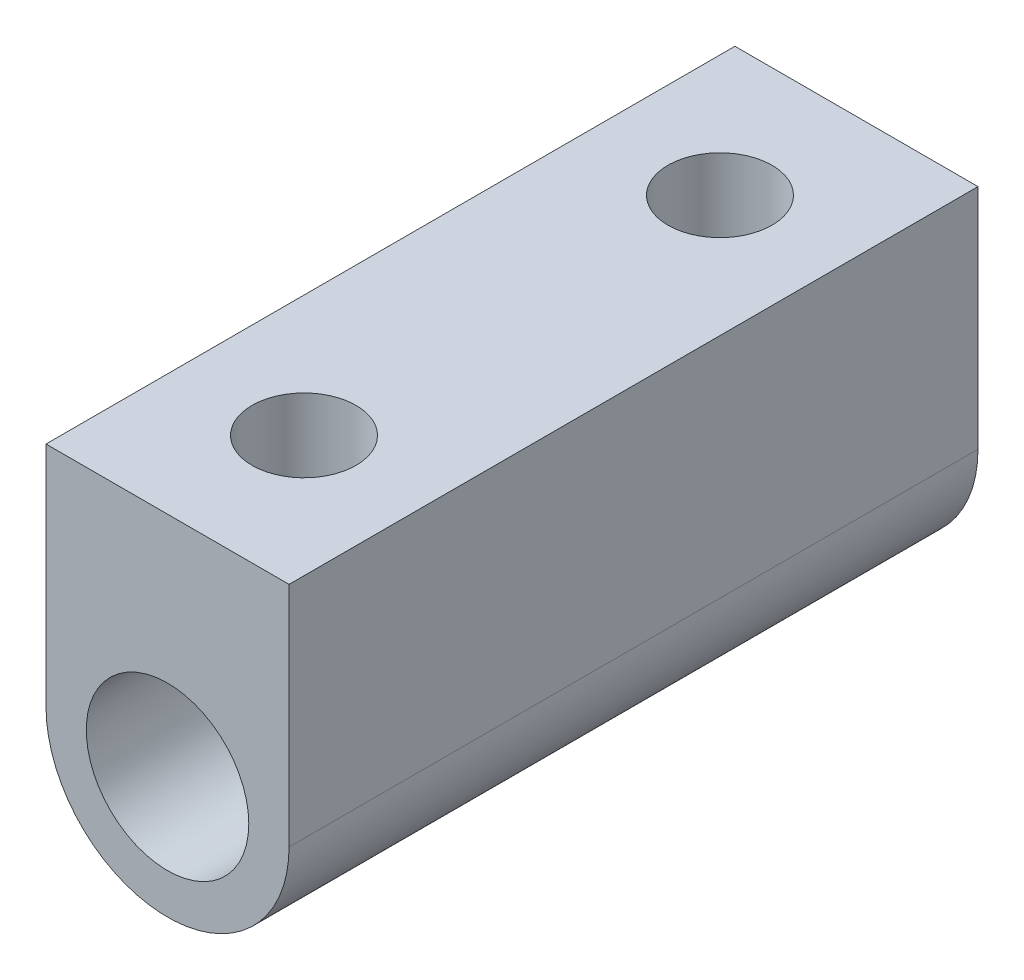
ISO-10303-21;
HEADER;
FILE_DESCRIPTION(('STEP AP214'),'2;1');
FILE_NAME('part.step','',(''),(''),'','','');
FILE_SCHEMA(('AUTOMOTIVE_DESIGN { 1 0 10303 214 1 1 1 1 }'));
ENDSEC;
DATA;
#1=APPLICATION_CONTEXT('core data for automotive mechanical design processes');
#2=APPLICATION_PROTOCOL_DEFINITION('international standard','automotive_design',2000,#1);
#3=PRODUCT_CONTEXT('',#1,'mechanical');
#4=PRODUCT('Part','Part','',(#3));
#5=PRODUCT_RELATED_PRODUCT_CATEGORY('part','',(#4));
#6=PRODUCT_DEFINITION_FORMATION('','',#4);
#7=PRODUCT_DEFINITION_CONTEXT('part definition',#1,'design');
#8=PRODUCT_DEFINITION('design','',#6,#7);
#9=PRODUCT_DEFINITION_SHAPE('','',#8);
#10=(LENGTH_UNIT() NAMED_UNIT(*) SI_UNIT(.MILLI.,.METRE.));
#11=(NAMED_UNIT(*) PLANE_ANGLE_UNIT() SI_UNIT($,.RADIAN.));
#12=(NAMED_UNIT(*) SI_UNIT($,.STERADIAN.) SOLID_ANGLE_UNIT());
#13=UNCERTAINTY_MEASURE_WITH_UNIT(LENGTH_MEASURE(1.E-05),#10,'distance_accuracy_value','');
#14=(GEOMETRIC_REPRESENTATION_CONTEXT(3) GLOBAL_UNCERTAINTY_ASSIGNED_CONTEXT((#13)) GLOBAL_UNIT_ASSIGNED_CONTEXT((#10,
#11,#12)) REPRESENTATION_CONTEXT('',''));
#15=CARTESIAN_POINT('',(0.,0.,0.));
#16=DIRECTION('',(0.,0.,1.));
#17=DIRECTION('',(1.,0.,0.));
#18=AXIS2_PLACEMENT_3D('',#15,#16,#17);
#19=CARTESIAN_POINT('',(1.87,0.,14.3440430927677));
#20=DIRECTION('',(-1.,0.,0.));
#21=DIRECTION('',(0.,0.,1.));
#22=AXIS2_PLACEMENT_3D('',#19,#20,#21);
#23=PLANE('',#22);
#24=DIRECTION('',(0.,0.,-1.));
#25=VECTOR('',#24,1.);
#26=CARTESIAN_POINT('',(1.87,3.5,14.3440430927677));
#27=LINE('',#26,#25);
#28=CARTESIAN_POINT('',(1.87,3.5,5.3));
#29=VERTEX_POINT('',#28);
#30=CARTESIAN_POINT('',(1.87,3.5,-5.3));
#31=VERTEX_POINT('',#30);
#32=EDGE_CURVE('E110',#29,#31,#27,.T.);
#33=ORIENTED_EDGE('',*,*,#32,.F.);
#34=DIRECTION('',(0.,-1.,0.));
#35=VECTOR('',#34,1.);
#36=CARTESIAN_POINT('',(1.87,0.,5.3));
#37=LINE('',#36,#35);
#38=CARTESIAN_POINT('',(1.87,0.,5.3));
#39=VERTEX_POINT('',#38);
#40=EDGE_CURVE('E51',#29,#39,#37,.T.);
#41=ORIENTED_EDGE('',*,*,#40,.T.);
#42=DIRECTION('',(0.,0.,-1.));
#43=VECTOR('',#42,1.);
#44=CARTESIAN_POINT('',(1.87,0.,14.3440430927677));
#45=LINE('',#44,#43);
#46=CARTESIAN_POINT('',(1.87,0.,-5.3));
#47=VERTEX_POINT('',#46);
#48=EDGE_CURVE('E95',#39,#47,#45,.T.);
#49=ORIENTED_EDGE('',*,*,#48,.T.);
#50=DIRECTION('',(0.,-1.,0.));
#51=VECTOR('',#50,1.);
#52=CARTESIAN_POINT('',(1.87,0.,-5.3));
#53=LINE('',#52,#51);
#54=EDGE_CURVE('E105',#31,#47,#53,.T.);
#55=ORIENTED_EDGE('',*,*,#54,.F.);
#56=EDGE_LOOP('',(#33,#41,#49,#55));
#57=FACE_BOUND('',#56,.T.);
#58=ADVANCED_FACE('F47',(#57),#23,.F.);
#59=CARTESIAN_POINT('',(0.,0.,14.3440430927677));
#60=DIRECTION('',(0.,0.,-1.));
#61=DIRECTION('',(-1.,0.,0.));
#62=AXIS2_PLACEMENT_3D('',#59,#60,#61);
#63=CYLINDRICAL_SURFACE('',#62,1.87);
#64=ORIENTED_EDGE('',*,*,#48,.F.);
#65=CARTESIAN_POINT('',(0.,0.,5.3));
#66=DIRECTION('',(0.,0.,-1.));
#67=DIRECTION('',(-1.,0.,0.));
#68=AXIS2_PLACEMENT_3D('',#65,#66,#67);
#69=CIRCLE('',#68,1.87);
#70=CARTESIAN_POINT('',(-1.87,0.,5.3));
#71=VERTEX_POINT('',#70);
#72=EDGE_CURVE('E91',#39,#71,#69,.T.);
#73=ORIENTED_EDGE('',*,*,#72,.T.);
#74=DIRECTION('',(0.,0.,-1.));
#75=VECTOR('',#74,1.);
#76=CARTESIAN_POINT('',(-1.87,0.,14.3440430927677));
#77=LINE('',#76,#75);
#78=CARTESIAN_POINT('',(-1.87,0.,-5.3));
#79=VERTEX_POINT('',#78);
#80=EDGE_CURVE('E86',#71,#79,#77,.T.);
#81=ORIENTED_EDGE('',*,*,#80,.T.);
#82=CARTESIAN_POINT('',(0.,0.,-5.3));
#83=DIRECTION('',(0.,0.,1.));
#84=DIRECTION('',(1.,0.,0.));
#85=AXIS2_PLACEMENT_3D('',#82,#83,#84);
#86=CIRCLE('',#85,1.87);
#87=EDGE_CURVE('E90',#47,#79,#86,.F.);
#88=ORIENTED_EDGE('',*,*,#87,.F.);
#89=EDGE_LOOP('',(#64,#73,#81,#88));
#90=FACE_BOUND('',#89,.T.);
#91=ADVANCED_FACE('F89',(#90),#63,.T.);
#92=CARTESIAN_POINT('',(-1.87,3.5,14.3440430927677));
#93=DIRECTION('',(1.,0.,0.));
#94=DIRECTION('',(0.,1.,0.));
#95=AXIS2_PLACEMENT_3D('',#92,#93,#94);
#96=PLANE('',#95);
#97=ORIENTED_EDGE('',*,*,#80,.F.);
#98=DIRECTION('',(0.,1.,0.));
#99=VECTOR('',#98,1.);
#100=CARTESIAN_POINT('',(-1.87,3.5,5.3));
#101=LINE('',#100,#99);
#102=CARTESIAN_POINT('',(-1.87,3.5,5.3));
#103=VERTEX_POINT('',#102);
#104=EDGE_CURVE('E56',#71,#103,#101,.T.);
#105=ORIENTED_EDGE('',*,*,#104,.T.);
#106=DIRECTION('',(0.,0.,-1.));
#107=VECTOR('',#106,1.);
#108=CARTESIAN_POINT('',(-1.87,3.5,14.3440430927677));
#109=LINE('',#108,#107);
#110=CARTESIAN_POINT('',(-1.87,3.5,-5.3));
#111=VERTEX_POINT('',#110);
#112=EDGE_CURVE('E94',#103,#111,#109,.T.);
#113=ORIENTED_EDGE('',*,*,#112,.T.);
#114=DIRECTION('',(0.,1.,0.));
#115=VECTOR('',#114,1.);
#116=CARTESIAN_POINT('',(-1.87,3.5,-5.3));
#117=LINE('',#116,#115);
#118=EDGE_CURVE('E102',#79,#111,#117,.T.);
#119=ORIENTED_EDGE('',*,*,#118,.F.);
#120=EDGE_LOOP('',(#97,#105,#113,#119));
#121=FACE_BOUND('',#120,.T.);
#122=ADVANCED_FACE('F108',(#121),#96,.F.);
#123=CARTESIAN_POINT('',(1.87,3.5,14.3440430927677));
#124=DIRECTION('',(0.,-1.,0.));
#125=DIRECTION('',(0.,0.,-1.));
#126=AXIS2_PLACEMENT_3D('',#123,#124,#125);
#127=PLANE('',#126);
#128=CARTESIAN_POINT('',(0.,3.5,3.2));
#129=DIRECTION('',(0.,1.,0.));
#130=DIRECTION('',(0.,0.,1.));
#131=AXIS2_PLACEMENT_3D('',#128,#129,#130);
#132=CIRCLE('',#131,0.799999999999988);
#133=CARTESIAN_POINT('',(0.,3.5,3.99999999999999));
#134=VERTEX_POINT('',#133);
#135=EDGE_CURVE('E286',#134,#134,#132,.T.);
#136=ORIENTED_EDGE('',*,*,#135,.F.);
#137=EDGE_LOOP('',(#136));
#138=FACE_BOUND('',#137,.T.);
#139=CARTESIAN_POINT('',(0.,3.5,-3.2));
#140=DIRECTION('',(0.,1.,0.));
#141=DIRECTION('',(0.,0.,1.));
#142=AXIS2_PLACEMENT_3D('',#139,#140,#141);
#143=CIRCLE('',#142,0.799999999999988);
#144=CARTESIAN_POINT('',(0.,3.5,-2.40000000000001));
#145=VERTEX_POINT('',#144);
#146=EDGE_CURVE('E272',#145,#145,#143,.T.);
#147=ORIENTED_EDGE('',*,*,#146,.F.);
#148=EDGE_LOOP('',(#147));
#149=FACE_BOUND('',#148,.T.);
#150=ORIENTED_EDGE('',*,*,#112,.F.);
#151=DIRECTION('',(1.,0.,0.));
#152=VECTOR('',#151,1.);
#153=CARTESIAN_POINT('',(1.87,3.5,5.3));
#154=LINE('',#153,#152);
#155=EDGE_CURVE('E11',#103,#29,#154,.T.);
#156=ORIENTED_EDGE('',*,*,#155,.T.);
#157=ORIENTED_EDGE('',*,*,#32,.T.);
#158=DIRECTION('',(1.,0.,0.));
#159=VECTOR('',#158,1.);
#160=CARTESIAN_POINT('',(1.87,3.5,-5.3));
#161=LINE('',#160,#159);
#162=EDGE_CURVE('E111',#111,#31,#161,.T.);
#163=ORIENTED_EDGE('',*,*,#162,.F.);
#164=EDGE_LOOP('',(#150,#156,#157,#163));
#165=FACE_BOUND('',#164,.T.);
#166=ADVANCED_FACE('F49',(#138,#149,#165),#127,.F.);
#167=CARTESIAN_POINT('',(0.,0.,5.3));
#168=DIRECTION('',(0.,0.,-1.));
#169=DIRECTION('',(-1.,0.,0.));
#170=AXIS2_PLACEMENT_3D('',#167,#168,#169);
#171=PLANE('',#170);
#172=CARTESIAN_POINT('',(0.,0.,5.3));
#173=DIRECTION('',(0.,0.,1.));
#174=DIRECTION('',(1.,0.,0.));
#175=AXIS2_PLACEMENT_3D('',#172,#173,#174);
#176=CIRCLE('',#175,1.25);
#177=CARTESIAN_POINT('',(1.25,0.,5.3));
#178=VERTEX_POINT('',#177);
#179=EDGE_CURVE('E271',#178,#178,#176,.T.);
#180=ORIENTED_EDGE('',*,*,#179,.F.);
#181=EDGE_LOOP('',(#180));
#182=FACE_BOUND('',#181,.T.);
#183=ORIENTED_EDGE('',*,*,#104,.F.);
#184=ORIENTED_EDGE('',*,*,#72,.F.);
#185=ORIENTED_EDGE('',*,*,#40,.F.);
#186=ORIENTED_EDGE('',*,*,#155,.F.);
#187=EDGE_LOOP('',(#183,#184,#185,#186));
#188=FACE_BOUND('',#187,.T.);
#189=ADVANCED_FACE('F122',(#182,#188),#171,.F.);
#190=CARTESIAN_POINT('',(0.,0.,-5.3));
#191=DIRECTION('',(0.,0.,1.));
#192=DIRECTION('',(-1.,0.,0.));
#193=AXIS2_PLACEMENT_3D('',#190,#191,#192);
#194=PLANE('',#193);
#195=CARTESIAN_POINT('',(0.,0.,-5.3));
#196=DIRECTION('',(0.,0.,1.));
#197=DIRECTION('',(1.,0.,0.));
#198=AXIS2_PLACEMENT_3D('',#195,#196,#197);
#199=CIRCLE('',#198,1.25);
#200=CARTESIAN_POINT('',(1.25,0.,-5.3));
#201=VERTEX_POINT('',#200);
#202=EDGE_CURVE('E106',#201,#201,#199,.T.);
#203=ORIENTED_EDGE('',*,*,#202,.T.);
#204=EDGE_LOOP('',(#203));
#205=FACE_BOUND('',#204,.T.);
#206=ORIENTED_EDGE('',*,*,#162,.T.);
#207=ORIENTED_EDGE('',*,*,#54,.T.);
#208=ORIENTED_EDGE('',*,*,#87,.T.);
#209=ORIENTED_EDGE('',*,*,#118,.T.);
#210=EDGE_LOOP('',(#206,#207,#208,#209));
#211=FACE_BOUND('',#210,.T.);
#212=ADVANCED_FACE('F101',(#205,#211),#194,.F.);
#213=CARTESIAN_POINT('',(0.,0.,-5.3));
#214=DIRECTION('',(0.,0.,1.));
#215=DIRECTION('',(1.,0.,0.));
#216=AXIS2_PLACEMENT_3D('',#213,#214,#215);
#217=CYLINDRICAL_SURFACE('',#216,1.25);
#218=CARTESIAN_POINT('',(0.,1.25,3.99999999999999));
#219=CARTESIAN_POINT('',(0.0404744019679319,1.24999736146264,3.99999718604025));
#220=CARTESIAN_POINT('',(0.0809896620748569,1.2480141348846,3.99690794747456));
#221=CARTESIAN_POINT('',(0.160765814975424,1.24026927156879,3.98472232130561));
#222=CARTESIAN_POINT('',(0.200024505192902,1.23450134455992,3.97561593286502));
#223=CARTESIAN_POINT('',(0.275981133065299,1.21976405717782,3.95193723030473));
#224=CARTESIAN_POINT('',(0.31269074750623,1.21081062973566,3.93739210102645));
#225=CARTESIAN_POINT('',(0.383012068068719,1.19043854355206,3.90344015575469));
#226=CARTESIAN_POINT('',(0.416623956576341,1.17902003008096,3.88403362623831));
#227=CARTESIAN_POINT('',(0.482904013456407,1.15354447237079,3.83916682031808));
#228=CARTESIAN_POINT('',(0.515270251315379,1.1393480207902,3.8133412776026));
#229=CARTESIAN_POINT('',(0.575503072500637,1.11014382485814,3.75721993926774));
#230=CARTESIAN_POINT('',(0.603363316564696,1.09513497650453,3.72691795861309));
#231=CARTESIAN_POINT('',(0.657865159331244,1.06341080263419,3.65763168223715));
#232=CARTESIAN_POINT('',(0.683759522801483,1.04675928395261,3.61802545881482));
#233=CARTESIAN_POINT('',(0.72846263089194,1.0161582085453,3.53405739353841));
#234=CARTESIAN_POINT('',(0.747283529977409,1.00220403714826,3.48970387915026));
#235=CARTESIAN_POINT('',(0.772859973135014,0.98253470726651,3.40963161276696));
#236=CARTESIAN_POINT('',(0.78150101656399,0.975612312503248,3.37481401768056));
#237=CARTESIAN_POINT('',(0.794048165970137,0.965429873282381,3.303834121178));
#238=CARTESIAN_POINT('',(0.797961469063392,0.962164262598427,3.26767395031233));
#239=CARTESIAN_POINT('',(0.800814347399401,0.959792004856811,3.19490319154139));
#240=CARTESIAN_POINT('',(0.799738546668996,0.960698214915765,3.15829155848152));
#241=CARTESIAN_POINT('',(0.792653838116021,0.966550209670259,3.08586718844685));
#242=CARTESIAN_POINT('',(0.78664085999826,0.971499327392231,3.05005513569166));
#243=CARTESIAN_POINT('',(0.770292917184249,0.98450615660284,2.98121972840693));
#244=CARTESIAN_POINT('',(0.760092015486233,0.992466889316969,2.948145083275));
#245=CARTESIAN_POINT('',(0.735795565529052,1.01061082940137,2.88412228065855));
#246=CARTESIAN_POINT('',(0.721698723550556,1.02079477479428,2.85317483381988));
#247=CARTESIAN_POINT('',(0.686883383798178,1.04461313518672,2.7879186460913));
#248=CARTESIAN_POINT('',(0.665411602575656,1.0585339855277,2.75411684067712));
#249=CARTESIAN_POINT('',(0.617823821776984,1.08699784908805,2.69021226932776));
#250=CARTESIAN_POINT('',(0.591702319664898,1.10154158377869,2.66011395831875));
#251=CARTESIAN_POINT('',(0.529959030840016,1.13271642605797,2.59886524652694));
#252=CARTESIAN_POINT('',(0.493473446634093,1.14924460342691,2.56852369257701));
#253=CARTESIAN_POINT('',(0.415011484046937,1.1798443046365,2.51441323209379));
#254=CARTESIAN_POINT('',(0.373041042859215,1.19391844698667,2.49063730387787));
#255=CARTESIAN_POINT('',(0.293317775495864,1.21565570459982,2.45469496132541));
#256=CARTESIAN_POINT('',(0.256376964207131,1.22403655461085,2.44116167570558));
#257=CARTESIAN_POINT('',(0.180355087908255,1.23752090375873,2.41959658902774));
#258=CARTESIAN_POINT('',(0.141275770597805,1.24262703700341,2.41156036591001));
#259=CARTESIAN_POINT('',(0.0619078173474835,1.2491025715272,2.4013931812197));
#260=CARTESIAN_POINT('',(0.0216155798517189,1.25045944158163,2.39928202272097));
#261=CARTESIAN_POINT('',(-0.0587711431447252,1.24926443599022,2.4011494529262));
#262=CARTESIAN_POINT('',(-0.0988656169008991,1.24671233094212,2.40512839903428));
#263=CARTESIAN_POINT('',(-0.17550307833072,1.23818725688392,2.4185701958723));
#264=CARTESIAN_POINT('',(-0.212121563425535,1.23240331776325,2.42773033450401));
#265=CARTESIAN_POINT('',(-0.283207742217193,1.21803518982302,2.45087264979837));
#266=CARTESIAN_POINT('',(-0.317675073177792,1.2094505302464,2.46485563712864));
#267=CARTESIAN_POINT('',(-0.38630778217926,1.18938559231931,2.49833689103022));
#268=CARTESIAN_POINT('',(-0.420260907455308,1.17773769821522,2.51816745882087));
#269=CARTESIAN_POINT('',(-0.484520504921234,1.15279241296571,2.56222252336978));
#270=CARTESIAN_POINT('',(-0.514824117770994,1.13949374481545,2.58645042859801));
#271=CARTESIAN_POINT('',(-0.575786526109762,1.11008201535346,2.64282187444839));
#272=CARTESIAN_POINT('',(-0.605793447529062,1.09384921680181,2.67560917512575));
#273=CARTESIAN_POINT('',(-0.660109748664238,1.0619543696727,2.74587710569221));
#274=CARTESIAN_POINT('',(-0.684418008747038,1.04629243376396,2.7833586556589));
#275=CARTESIAN_POINT('',(-0.723858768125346,1.01932329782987,2.8571715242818));
#276=CARTESIAN_POINT('',(-0.739790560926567,1.00771350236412,2.89296248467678));
#277=CARTESIAN_POINT('',(-0.766411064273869,0.987620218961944,2.96726286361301));
#278=CARTESIAN_POINT('',(-0.777107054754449,0.979132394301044,3.005768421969));
#279=CARTESIAN_POINT('',(-0.792737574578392,0.966526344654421,3.08505862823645));
#280=CARTESIAN_POINT('',(-0.79761694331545,0.962449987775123,3.12586131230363));
#281=CARTESIAN_POINT('',(-0.801011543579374,0.959628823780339,3.20790451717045));
#282=CARTESIAN_POINT('',(-0.799531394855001,0.960880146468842,3.24914469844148));
#283=CARTESIAN_POINT('',(-0.791023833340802,0.967885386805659,3.32454208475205));
#284=CARTESIAN_POINT('',(-0.784826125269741,0.972964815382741,3.35886391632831));
#285=CARTESIAN_POINT('',(-0.768225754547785,0.986124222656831,3.42588257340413));
#286=CARTESIAN_POINT('',(-0.757818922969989,0.994207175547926,3.45857775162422));
#287=CARTESIAN_POINT('',(-0.72893906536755,1.01566279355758,3.53276672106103));
#288=CARTESIAN_POINT('',(-0.708922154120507,1.02989842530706,3.57340880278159));
#289=CARTESIAN_POINT('',(-0.662757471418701,1.06019607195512,3.65029928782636));
#290=CARTESIAN_POINT('',(-0.636601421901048,1.07626053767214,3.68654165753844));
#291=CARTESIAN_POINT('',(-0.578333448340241,1.10867273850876,3.7545796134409));
#292=CARTESIAN_POINT('',(-0.54615500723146,1.12502158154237,3.78631780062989));
#293=CARTESIAN_POINT('',(-0.47647538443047,1.15625592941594,3.84422154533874));
#294=CARTESIAN_POINT('',(-0.438974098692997,1.17114140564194,3.87038699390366));
#295=CARTESIAN_POINT('',(-0.357971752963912,1.19843219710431,3.91701323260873));
#296=CARTESIAN_POINT('',(-0.31431819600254,1.21074394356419,3.93726691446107));
#297=CARTESIAN_POINT('',(-0.223200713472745,1.23078703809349,3.96974122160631));
#298=CARTESIAN_POINT('',(-0.175749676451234,1.2385331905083,3.98198782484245));
#299=CARTESIAN_POINT('',(-0.106386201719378,1.24564540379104,3.99318189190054));
#300=CARTESIAN_POINT('',(-0.0852273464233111,1.24727297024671,3.9957332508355));
#301=CARTESIAN_POINT('',(-0.0427161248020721,1.2494509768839,3.99914306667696));
#302=CARTESIAN_POINT('',(-0.0213637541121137,1.25000139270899,4.00000148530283));
#303=CARTESIAN_POINT('',(0.,1.25,3.99999999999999));
#304=B_SPLINE_CURVE_WITH_KNOTS('',3,(#218,#219,#220,#221,#222,#223,#224,#225,#226,#227,#228,
#229,#230,#231,#232,#233,#234,#235,#236,#237,#238,#239,#240,#241,#242,#243,#244,#245,#246,#247,
#248,#249,#250,#251,#252,#253,#254,#255,#256,#257,#258,#259,#260,#261,#262,#263,#264,#265,#266,
#267,#268,#269,#270,#271,#272,#273,#274,#275,#276,#277,#278,#279,#280,#281,#282,#283,#284,#285,
#286,#287,#288,#289,#290,#291,#292,#293,#294,#295,#296,#297,#298,#299,#300,#301,#302,#303),
.UNSPECIFIED.,.T.,.F.,(4,2,2,2,2,2,2,2,2,2,2,2,2,2,2,2,2,2,2,2,2,2,2,2,2,2,2,2,2,2,2,2,2,2,2,2,
2,2,2,2,2,2,4),(0.,0.121334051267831,0.242870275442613,0.363806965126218,0.484736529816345,
0.615554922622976,0.746555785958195,0.896336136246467,1.04585792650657,1.15501692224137,
1.26400953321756,1.37333827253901,1.48275723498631,1.58891719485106,1.69511244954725,
1.82183926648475,1.94871706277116,2.09872950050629,2.24858087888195,2.36874123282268,
2.48880481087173,2.6092691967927,2.72974065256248,2.84380900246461,2.95789653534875,
3.08045111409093,3.20310109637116,3.34447300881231,3.4858726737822,3.60798687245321,
3.72993079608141,3.85302217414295,3.97602414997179,4.08130959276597,4.18669957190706,
4.32841604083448,4.47032471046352,4.61390470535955,4.75748750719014,4.90562143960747,
5.05327235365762,5.1173151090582,5.18135931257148),.UNSPECIFIED.);
#305=CARTESIAN_POINT('',(0.,1.25,3.99999999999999));
#306=VERTEX_POINT('',#305);
#307=EDGE_CURVE('E281',#306,#306,#304,.T.);
#308=ORIENTED_EDGE('',*,*,#307,.T.);
#309=EDGE_LOOP('',(#308));
#310=FACE_BOUND('',#309,.T.);
#311=CARTESIAN_POINT('',(0.,1.25,-2.40000000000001));
#312=CARTESIAN_POINT('',(0.0404744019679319,1.24999736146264,-2.40000281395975));
#313=CARTESIAN_POINT('',(0.0809896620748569,1.2480141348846,-2.40309205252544));
#314=CARTESIAN_POINT('',(0.160765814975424,1.24026927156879,-2.41527767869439));
#315=CARTESIAN_POINT('',(0.200024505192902,1.23450134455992,-2.42438406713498));
#316=CARTESIAN_POINT('',(0.275981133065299,1.21976405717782,-2.44806276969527));
#317=CARTESIAN_POINT('',(0.31269074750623,1.21081062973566,-2.46260789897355));
#318=CARTESIAN_POINT('',(0.383012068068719,1.19043854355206,-2.49655984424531));
#319=CARTESIAN_POINT('',(0.416623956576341,1.17902003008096,-2.51596637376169));
#320=CARTESIAN_POINT('',(0.482904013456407,1.15354447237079,-2.56083317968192));
#321=CARTESIAN_POINT('',(0.515270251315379,1.1393480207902,-2.5866587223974));
#322=CARTESIAN_POINT('',(0.575503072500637,1.11014382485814,-2.64278006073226));
#323=CARTESIAN_POINT('',(0.603363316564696,1.09513497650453,-2.67308204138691));
#324=CARTESIAN_POINT('',(0.657865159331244,1.06341080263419,-2.74236831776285));
#325=CARTESIAN_POINT('',(0.683759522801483,1.04675928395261,-2.78197454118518));
#326=CARTESIAN_POINT('',(0.72846263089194,1.0161582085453,-2.86594260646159));
#327=CARTESIAN_POINT('',(0.747283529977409,1.00220403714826,-2.91029612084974));
#328=CARTESIAN_POINT('',(0.772859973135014,0.98253470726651,-2.99036838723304));
#329=CARTESIAN_POINT('',(0.78150101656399,0.975612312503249,-3.02518598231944));
#330=CARTESIAN_POINT('',(0.794048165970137,0.965429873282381,-3.096165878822));
#331=CARTESIAN_POINT('',(0.797961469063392,0.962164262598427,-3.13232604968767));
#332=CARTESIAN_POINT('',(0.800814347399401,0.959792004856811,-3.20509680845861));
#333=CARTESIAN_POINT('',(0.799738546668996,0.960698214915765,-3.24170844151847));
#334=CARTESIAN_POINT('',(0.792653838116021,0.966550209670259,-3.31413281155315));
#335=CARTESIAN_POINT('',(0.78664085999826,0.971499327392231,-3.34994486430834));
#336=CARTESIAN_POINT('',(0.770292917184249,0.98450615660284,-3.41878027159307));
#337=CARTESIAN_POINT('',(0.760092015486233,0.992466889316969,-3.451854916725));
#338=CARTESIAN_POINT('',(0.735795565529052,1.01061082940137,-3.51587771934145));
#339=CARTESIAN_POINT('',(0.721698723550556,1.02079477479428,-3.54682516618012));
#340=CARTESIAN_POINT('',(0.686883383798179,1.04461313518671,-3.6120813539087));
#341=CARTESIAN_POINT('',(0.665411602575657,1.05853398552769,-3.64588315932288));
#342=CARTESIAN_POINT('',(0.617823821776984,1.08699784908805,-3.70978773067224));
#343=CARTESIAN_POINT('',(0.591702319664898,1.10154158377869,-3.73988604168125));
#344=CARTESIAN_POINT('',(0.529959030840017,1.13271642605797,-3.80113475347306));
#345=CARTESIAN_POINT('',(0.493473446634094,1.14924460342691,-3.83147630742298));
#346=CARTESIAN_POINT('',(0.415011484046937,1.1798443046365,-3.88558676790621));
#347=CARTESIAN_POINT('',(0.373041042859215,1.19391844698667,-3.90936269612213));
#348=CARTESIAN_POINT('',(0.293317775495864,1.21565570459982,-3.94530503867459));
#349=CARTESIAN_POINT('',(0.256376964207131,1.22403655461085,-3.95883832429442));
#350=CARTESIAN_POINT('',(0.180355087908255,1.23752090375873,-3.98040341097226));
#351=CARTESIAN_POINT('',(0.141275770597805,1.24262703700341,-3.98843963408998));
#352=CARTESIAN_POINT('',(0.0619078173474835,1.2491025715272,-3.9986068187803));
#353=CARTESIAN_POINT('',(0.0216155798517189,1.25045944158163,-4.00071797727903));
#354=CARTESIAN_POINT('',(-0.0587711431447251,1.24926443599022,-3.9988505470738));
#355=CARTESIAN_POINT('',(-0.0988656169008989,1.24671233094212,-3.99487160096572));
#356=CARTESIAN_POINT('',(-0.17550307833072,1.23818725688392,-3.98142980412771));
#357=CARTESIAN_POINT('',(-0.212121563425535,1.23240331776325,-3.97226966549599));
#358=CARTESIAN_POINT('',(-0.283207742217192,1.21803518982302,-3.94912735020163));
#359=CARTESIAN_POINT('',(-0.317675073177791,1.2094505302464,-3.93514436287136));
#360=CARTESIAN_POINT('',(-0.38630778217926,1.18938559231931,-3.90166310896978));
#361=CARTESIAN_POINT('',(-0.420260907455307,1.17773769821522,-3.88183254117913));
#362=CARTESIAN_POINT('',(-0.484520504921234,1.15279241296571,-3.83777747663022));
#363=CARTESIAN_POINT('',(-0.514824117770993,1.13949374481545,-3.81354957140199));
#364=CARTESIAN_POINT('',(-0.575786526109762,1.11008201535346,-3.75717812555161));
#365=CARTESIAN_POINT('',(-0.605793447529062,1.09384921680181,-3.72439082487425));
#366=CARTESIAN_POINT('',(-0.660109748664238,1.0619543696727,-3.65412289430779));
#367=CARTESIAN_POINT('',(-0.684418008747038,1.04629243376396,-3.6166413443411));
#368=CARTESIAN_POINT('',(-0.723858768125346,1.01932329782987,-3.5428284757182));
#369=CARTESIAN_POINT('',(-0.739790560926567,1.00771350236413,-3.50703751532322));
#370=CARTESIAN_POINT('',(-0.766411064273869,0.987620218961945,-3.43273713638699));
#371=CARTESIAN_POINT('',(-0.777107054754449,0.979132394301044,-3.394231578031));
#372=CARTESIAN_POINT('',(-0.792737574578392,0.966526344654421,-3.31494137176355));
#373=CARTESIAN_POINT('',(-0.79761694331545,0.962449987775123,-3.27413868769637));
#374=CARTESIAN_POINT('',(-0.801011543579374,0.959628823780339,-3.19209548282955));
#375=CARTESIAN_POINT('',(-0.799531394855,0.960880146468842,-3.15085530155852));
#376=CARTESIAN_POINT('',(-0.791023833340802,0.967885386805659,-3.07545791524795));
#377=CARTESIAN_POINT('',(-0.784826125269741,0.972964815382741,-3.04113608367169));
#378=CARTESIAN_POINT('',(-0.768225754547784,0.986124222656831,-2.97411742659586));
#379=CARTESIAN_POINT('',(-0.757818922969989,0.994207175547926,-2.94142224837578));
#380=CARTESIAN_POINT('',(-0.72893906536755,1.01566279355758,-2.86723327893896));
#381=CARTESIAN_POINT('',(-0.708922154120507,1.02989842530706,-2.82659119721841));
#382=CARTESIAN_POINT('',(-0.662757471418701,1.06019607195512,-2.74970071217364));
#383=CARTESIAN_POINT('',(-0.636601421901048,1.07626053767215,-2.71345834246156));
#384=CARTESIAN_POINT('',(-0.578333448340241,1.10867273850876,-2.6454203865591));
#385=CARTESIAN_POINT('',(-0.546155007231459,1.12502158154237,-2.6136821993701));
#386=CARTESIAN_POINT('',(-0.47647538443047,1.15625592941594,-2.55577845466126));
#387=CARTESIAN_POINT('',(-0.438974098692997,1.17114140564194,-2.52961300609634));
#388=CARTESIAN_POINT('',(-0.357971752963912,1.19843219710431,-2.48298676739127));
#389=CARTESIAN_POINT('',(-0.31431819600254,1.21074394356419,-2.46273308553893));
#390=CARTESIAN_POINT('',(-0.223200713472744,1.23078703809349,-2.43025877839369));
#391=CARTESIAN_POINT('',(-0.175749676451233,1.2385331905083,-2.41801217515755));
#392=CARTESIAN_POINT('',(-0.106386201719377,1.24564540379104,-2.40681810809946));
#393=CARTESIAN_POINT('',(-0.0852273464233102,1.24727297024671,-2.4042667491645));
#394=CARTESIAN_POINT('',(-0.0427161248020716,1.2494509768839,-2.40085693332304));
#395=CARTESIAN_POINT('',(-0.0213637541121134,1.25000139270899,-2.39999851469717));
#396=CARTESIAN_POINT('',(0.,1.25,-2.40000000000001));
#397=B_SPLINE_CURVE_WITH_KNOTS('',3,(#311,#312,#313,#314,#315,#316,#317,#318,#319,#320,#321,
#322,#323,#324,#325,#326,#327,#328,#329,#330,#331,#332,#333,#334,#335,#336,#337,#338,#339,#340,
#341,#342,#343,#344,#345,#346,#347,#348,#349,#350,#351,#352,#353,#354,#355,#356,#357,#358,#359,
#360,#361,#362,#363,#364,#365,#366,#367,#368,#369,#370,#371,#372,#373,#374,#375,#376,#377,#378,
#379,#380,#381,#382,#383,#384,#385,#386,#387,#388,#389,#390,#391,#392,#393,#394,#395,#396),
.UNSPECIFIED.,.T.,.F.,(4,2,2,2,2,2,2,2,2,2,2,2,2,2,2,2,2,2,2,2,2,2,2,2,2,2,2,2,2,2,2,2,2,2,2,2,
2,2,2,2,2,2,4),(0.,0.121334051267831,0.242870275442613,0.363806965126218,0.484736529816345,
0.615554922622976,0.746555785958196,0.896336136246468,1.04585792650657,1.15501692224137,
1.26400953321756,1.37333827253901,1.48275723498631,1.58891719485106,1.69511244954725,
1.82183926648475,1.94871706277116,2.09872950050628,2.24858087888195,2.36874123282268,
2.48880481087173,2.6092691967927,2.72974065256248,2.84380900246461,2.95789653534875,
3.08045111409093,3.20310109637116,3.34447300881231,3.4858726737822,3.60798687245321,
3.72993079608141,3.85302217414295,3.97602414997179,4.08130959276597,4.18669957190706,
4.32841604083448,4.47032471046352,4.61390470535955,4.75748750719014,4.90562143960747,
5.05327235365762,5.1173151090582,5.18135931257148),.UNSPECIFIED.);
#398=CARTESIAN_POINT('',(0.,1.25,-2.40000000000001));
#399=VERTEX_POINT('',#398);
#400=EDGE_CURVE('E264',#399,#399,#397,.T.);
#401=ORIENTED_EDGE('',*,*,#400,.T.);
#402=EDGE_LOOP('',(#401));
#403=FACE_BOUND('',#402,.T.);
#404=ORIENTED_EDGE('',*,*,#202,.F.);
#405=EDGE_LOOP('',(#404));
#406=FACE_BOUND('',#405,.T.);
#407=ORIENTED_EDGE('',*,*,#179,.T.);
#408=EDGE_LOOP('',(#407));
#409=FACE_BOUND('',#408,.T.);
#410=ADVANCED_FACE('F130',(#310,#403,#406,#409),#217,.F.);
#411=CARTESIAN_POINT('',(0.,3.5,-3.2));
#412=DIRECTION('',(0.,1.,0.));
#413=DIRECTION('',(0.,0.,1.));
#414=AXIS2_PLACEMENT_3D('',#411,#412,#413);
#415=CYLINDRICAL_SURFACE('',#414,0.799999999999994);
#416=ORIENTED_EDGE('',*,*,#400,.F.);
#417=EDGE_LOOP('',(#416));
#418=FACE_BOUND('',#417,.T.);
#419=ORIENTED_EDGE('',*,*,#146,.T.);
#420=EDGE_LOOP('',(#419));
#421=FACE_BOUND('',#420,.T.);
#422=ADVANCED_FACE('F167',(#418,#421),#415,.F.);
#423=CARTESIAN_POINT('',(0.,3.5,3.2));
#424=DIRECTION('',(0.,1.,0.));
#425=DIRECTION('',(0.,0.,1.));
#426=AXIS2_PLACEMENT_3D('',#423,#424,#425);
#427=CYLINDRICAL_SURFACE('',#426,0.799999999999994);
#428=ORIENTED_EDGE('',*,*,#307,.F.);
#429=EDGE_LOOP('',(#428));
#430=FACE_BOUND('',#429,.T.);
#431=ORIENTED_EDGE('',*,*,#135,.T.);
#432=EDGE_LOOP('',(#431));
#433=FACE_BOUND('',#432,.T.);
#434=ADVANCED_FACE('F171',(#430,#433),#427,.F.);
#435=CLOSED_SHELL('',(#58,#91,#122,#166,#189,#212,#410,#422,#434));
#436=MANIFOLD_SOLID_BREP('B2',#435);
#437=ADVANCED_BREP_SHAPE_REPRESENTATION('',(#18,#436),#14);
#438=SHAPE_DEFINITION_REPRESENTATION(#9,#437);
ENDSEC;
END-ISO-10303-21;
